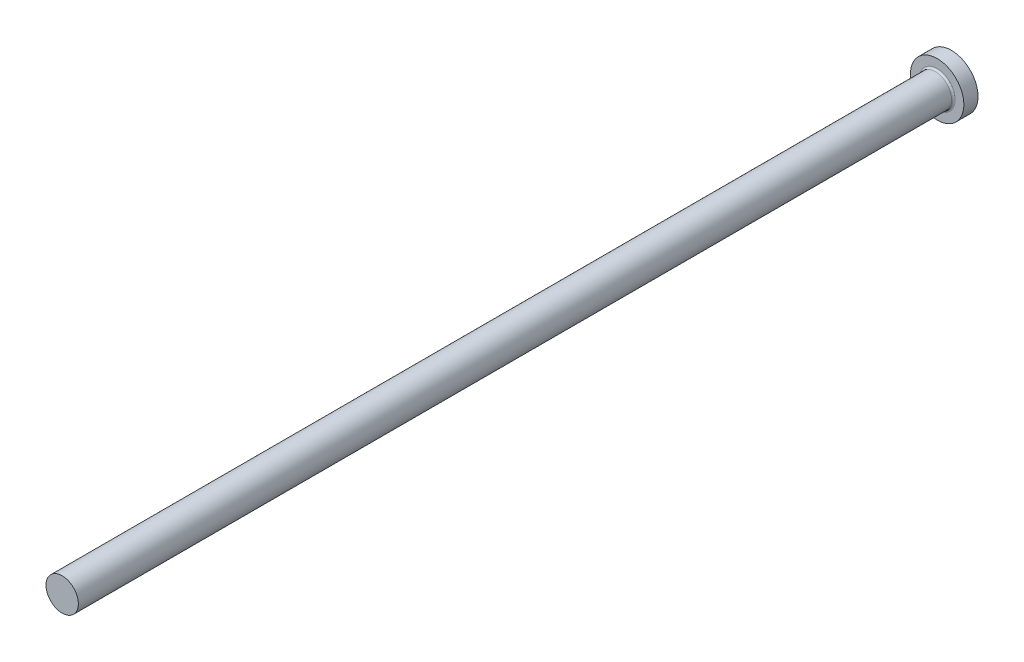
from build123d import *

# Parameters (mm, degrees)
FILLET1_R = 0.5


with BuildPart() as part:
    # FV → Revolve1 (revolve)
    with BuildSketch(Plane(origin=(0, 0, 0), x_dir=(1, 0, 0), z_dir=(0, 1, 0)), mode=Mode.PRIVATE) as revolve1_sk:
        Polygon((0, 0), (7.5, 0), (7.5, -4), (4.55, -4), (4.55, -250), (0, -250), align=None)
    revolve(revolve1_sk.sketch.rotate(Axis((0, 0, -9.033228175), (0, 0, 1)), 180), axis=Axis((0, 0, -9.033228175), (0, 0, 1)))

    # Fillet1
    fillet1_edges = [part.edges().sort_by_distance(p)[0] for p in [
        (4.55, 0, 4),
    ]]
    fillet(fillet1_edges, radius=FILLET1_R)


solid = part.part
